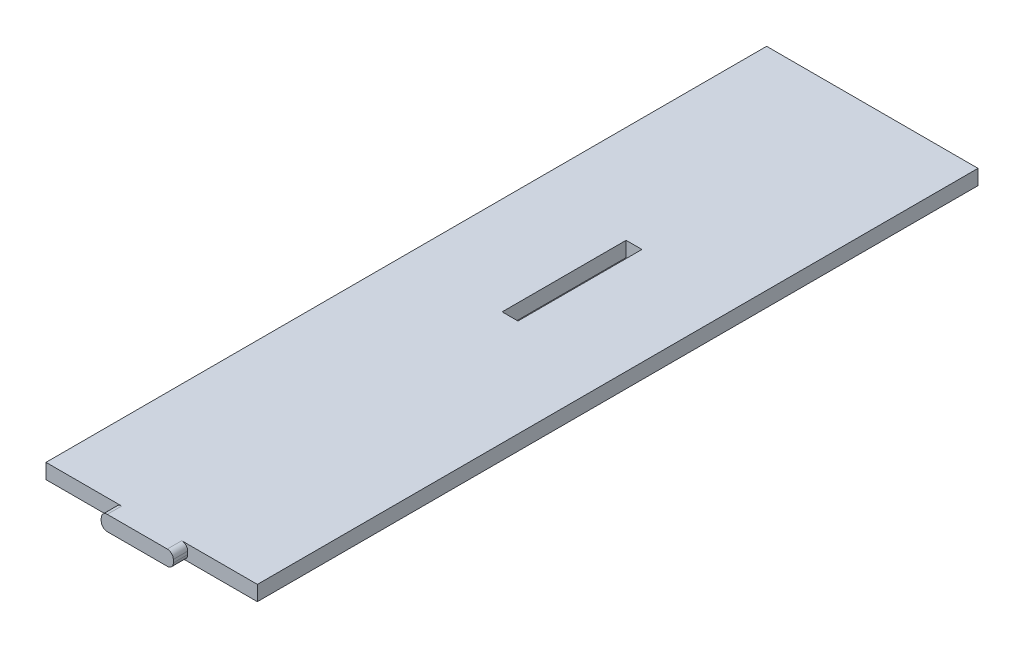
ISO-10303-21;
HEADER;
FILE_DESCRIPTION(('STEP AP214'),'2;1');
FILE_NAME('part.step','',(''),(''),'','','');
FILE_SCHEMA(('AUTOMOTIVE_DESIGN { 1 0 10303 214 1 1 1 1 }'));
ENDSEC;
DATA;
#1=APPLICATION_CONTEXT('core data for automotive mechanical design processes');
#2=APPLICATION_PROTOCOL_DEFINITION('international standard','automotive_design',2000,#1);
#3=PRODUCT_CONTEXT('',#1,'mechanical');
#4=PRODUCT('Part','Part','',(#3));
#5=PRODUCT_RELATED_PRODUCT_CATEGORY('part','',(#4));
#6=PRODUCT_DEFINITION_FORMATION('','',#4);
#7=PRODUCT_DEFINITION_CONTEXT('part definition',#1,'design');
#8=PRODUCT_DEFINITION('design','',#6,#7);
#9=PRODUCT_DEFINITION_SHAPE('','',#8);
#10=(LENGTH_UNIT() NAMED_UNIT(*) SI_UNIT(.MILLI.,.METRE.));
#11=(NAMED_UNIT(*) PLANE_ANGLE_UNIT() SI_UNIT($,.RADIAN.));
#12=(NAMED_UNIT(*) SI_UNIT($,.STERADIAN.) SOLID_ANGLE_UNIT());
#13=UNCERTAINTY_MEASURE_WITH_UNIT(LENGTH_MEASURE(1.E-05),#10,'distance_accuracy_value','');
#14=(GEOMETRIC_REPRESENTATION_CONTEXT(3) GLOBAL_UNCERTAINTY_ASSIGNED_CONTEXT((#13)) GLOBAL_UNIT_ASSIGNED_CONTEXT((#10,
#11,#12)) REPRESENTATION_CONTEXT('',''));
#15=CARTESIAN_POINT('',(0.,0.,0.));
#16=DIRECTION('',(0.,0.,1.));
#17=DIRECTION('',(1.,0.,0.));
#18=AXIS2_PLACEMENT_3D('',#15,#16,#17);
#19=CARTESIAN_POINT('',(-100.078955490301,12.5,350.));
#20=DIRECTION('',(0.,0.,-1.));
#21=DIRECTION('',(-1.,0.,0.));
#22=AXIS2_PLACEMENT_3D('',#19,#20,#21);
#23=PLANE('',#22);
#24=CARTESIAN_POINT('',(-37.0789554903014,4.99999999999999,350.));
#25=DIRECTION('',(0.,0.,1.));
#26=DIRECTION('',(1.,0.,0.));
#27=AXIS2_PLACEMENT_3D('',#24,#25,#26);
#28=CIRCLE('',#27,5.);
#29=CARTESIAN_POINT('',(-42.0789554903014,4.99999999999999,350.));
#30=VERTEX_POINT('',#29);
#31=CARTESIAN_POINT('',(-37.0789554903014,0.,350.));
#32=VERTEX_POINT('',#31);
#33=EDGE_CURVE('E48',#30,#32,#28,.T.);
#34=ORIENTED_EDGE('',*,*,#33,.F.);
#35=DIRECTION('',(0.,-1.,0.));
#36=VECTOR('',#35,1.);
#37=CARTESIAN_POINT('',(-42.0789554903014,7.5,350.));
#38=LINE('',#37,#36);
#39=CARTESIAN_POINT('',(-42.0789554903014,7.5,350.));
#40=VERTEX_POINT('',#39);
#41=EDGE_CURVE('E52',#40,#30,#38,.T.);
#42=ORIENTED_EDGE('',*,*,#41,.F.);
#43=CARTESIAN_POINT('',(-37.0789554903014,7.5,350.));
#44=DIRECTION('',(0.,0.,1.));
#45=DIRECTION('',(1.,0.,0.));
#46=AXIS2_PLACEMENT_3D('',#43,#44,#45);
#47=CIRCLE('',#46,5.);
#48=CARTESIAN_POINT('',(-37.0789554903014,12.5,350.));
#49=VERTEX_POINT('',#48);
#50=EDGE_CURVE('E264',#49,#40,#47,.T.);
#51=ORIENTED_EDGE('',*,*,#50,.F.);
#52=DIRECTION('',(1.,0.,0.));
#53=VECTOR('',#52,1.);
#54=CARTESIAN_POINT('',(-100.078955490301,12.5,350.));
#55=LINE('',#54,#53);
#56=CARTESIAN_POINT('',(-100.078955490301,12.5,350.));
#57=VERTEX_POINT('',#56);
#58=EDGE_CURVE('E210',#57,#49,#55,.T.);
#59=ORIENTED_EDGE('',*,*,#58,.F.);
#60=DIRECTION('',(0.,-1.,0.));
#61=VECTOR('',#60,1.);
#62=CARTESIAN_POINT('',(-100.078955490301,12.5,350.));
#63=LINE('',#62,#61);
#64=CARTESIAN_POINT('',(-100.078955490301,0.,350.));
#65=VERTEX_POINT('',#64);
#66=EDGE_CURVE('E11',#57,#65,#63,.T.);
#67=ORIENTED_EDGE('',*,*,#66,.T.);
#68=DIRECTION('',(1.,0.,0.));
#69=VECTOR('',#68,1.);
#70=CARTESIAN_POINT('',(-100.078955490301,0.,350.));
#71=LINE('',#70,#69);
#72=EDGE_CURVE('E221',#65,#32,#71,.T.);
#73=ORIENTED_EDGE('',*,*,#72,.T.);
#74=EDGE_LOOP('',(#34,#42,#51,#59,#67,#73));
#75=FACE_BOUND('',#74,.T.);
#76=ADVANCED_FACE('F33',(#75),#23,.F.);
#77=CARTESIAN_POINT('',(12.9210445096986,5.,350.));
#78=DIRECTION('',(0.,0.,1.));
#79=DIRECTION('',(1.,0.,0.));
#80=AXIS2_PLACEMENT_3D('',#77,#78,#79);
#81=CIRCLE('',#80,5.);
#82=CARTESIAN_POINT('',(12.9210445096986,0.,350.));
#83=VERTEX_POINT('',#82);
#84=CARTESIAN_POINT('',(17.9210445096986,5.,350.));
#85=VERTEX_POINT('',#84);
#86=EDGE_CURVE('E167',#83,#85,#81,.T.);
#87=ORIENTED_EDGE('',*,*,#86,.F.);
#88=CARTESIAN_POINT('',(75.9210445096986,0.,350.));
#89=VERTEX_POINT('',#88);
#90=EDGE_CURVE('E220',#83,#89,#71,.T.);
#91=ORIENTED_EDGE('',*,*,#90,.T.);
#92=DIRECTION('',(0.,-1.,0.));
#93=VECTOR('',#92,1.);
#94=CARTESIAN_POINT('',(75.9210445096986,12.5,350.));
#95=LINE('',#94,#93);
#96=CARTESIAN_POINT('',(75.9210445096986,12.5,350.));
#97=VERTEX_POINT('',#96);
#98=EDGE_CURVE('E41',#97,#89,#95,.T.);
#99=ORIENTED_EDGE('',*,*,#98,.F.);
#100=CARTESIAN_POINT('',(12.9210445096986,12.5,350.));
#101=VERTEX_POINT('',#100);
#102=EDGE_CURVE('E208',#101,#97,#55,.T.);
#103=ORIENTED_EDGE('',*,*,#102,.F.);
#104=CARTESIAN_POINT('',(12.9210445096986,7.50000000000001,350.));
#105=DIRECTION('',(0.,0.,1.));
#106=DIRECTION('',(-1.,0.,0.));
#107=AXIS2_PLACEMENT_3D('',#104,#105,#106);
#108=CIRCLE('',#107,5.);
#109=CARTESIAN_POINT('',(17.9210445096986,7.50000000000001,350.));
#110=VERTEX_POINT('',#109);
#111=EDGE_CURVE('E261',#110,#101,#108,.T.);
#112=ORIENTED_EDGE('',*,*,#111,.F.);
#113=DIRECTION('',(0.,1.,0.));
#114=VECTOR('',#113,1.);
#115=CARTESIAN_POINT('',(17.9210445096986,7.50000000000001,350.));
#116=LINE('',#115,#114);
#117=EDGE_CURVE('E265',#85,#110,#116,.T.);
#118=ORIENTED_EDGE('',*,*,#117,.F.);
#119=EDGE_LOOP('',(#87,#91,#99,#103,#112,#118));
#120=FACE_BOUND('',#119,.T.);
#121=ADVANCED_FACE('F260',(#120),#23,.F.);
#122=CARTESIAN_POINT('',(0.,12.5,0.));
#123=DIRECTION('',(0.,-1.,0.));
#124=DIRECTION('',(0.,0.,-1.));
#125=AXIS2_PLACEMENT_3D('',#122,#123,#124);
#126=PLANE('',#125);
#127=DIRECTION('',(0.,0.,1.));
#128=VECTOR('',#127,1.);
#129=CARTESIAN_POINT('',(-100.078955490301,12.5,350.));
#130=LINE('',#129,#128);
#131=CARTESIAN_POINT('',(-100.078955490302,12.5,-250.));
#132=VERTEX_POINT('',#131);
#133=EDGE_CURVE('E205',#132,#57,#130,.T.);
#134=ORIENTED_EDGE('',*,*,#133,.T.);
#135=ORIENTED_EDGE('',*,*,#58,.T.);
#136=DIRECTION('',(0.,0.,-1.));
#137=VECTOR('',#136,1.);
#138=CARTESIAN_POINT('',(-37.0789554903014,12.5,362.));
#139=LINE('',#138,#137);
#140=CARTESIAN_POINT('',(-37.0789554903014,12.5,362.));
#141=VERTEX_POINT('',#140);
#142=EDGE_CURVE('E284',#141,#49,#139,.T.);
#143=ORIENTED_EDGE('',*,*,#142,.F.);
#144=DIRECTION('',(-1.,0.,0.));
#145=VECTOR('',#144,1.);
#146=CARTESIAN_POINT('',(-37.0789554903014,12.5,362.));
#147=LINE('',#146,#145);
#148=CARTESIAN_POINT('',(12.9210445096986,12.5,362.));
#149=VERTEX_POINT('',#148);
#150=EDGE_CURVE('E290',#149,#141,#147,.T.);
#151=ORIENTED_EDGE('',*,*,#150,.F.);
#152=DIRECTION('',(0.,0.,-1.));
#153=VECTOR('',#152,1.);
#154=CARTESIAN_POINT('',(12.9210445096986,12.5,362.));
#155=LINE('',#154,#153);
#156=EDGE_CURVE('E173',#149,#101,#155,.T.);
#157=ORIENTED_EDGE('',*,*,#156,.T.);
#158=ORIENTED_EDGE('',*,*,#102,.T.);
#159=DIRECTION('',(0.,0.,-1.));
#160=VECTOR('',#159,1.);
#161=CARTESIAN_POINT('',(75.9210445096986,12.5,350.));
#162=LINE('',#161,#160);
#163=CARTESIAN_POINT('',(75.9210445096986,12.5,-250.));
#164=VERTEX_POINT('',#163);
#165=EDGE_CURVE('E213',#97,#164,#162,.T.);
#166=ORIENTED_EDGE('',*,*,#165,.T.);
#167=DIRECTION('',(-1.,0.,0.));
#168=VECTOR('',#167,1.);
#169=CARTESIAN_POINT('',(-100.078955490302,12.5,-250.));
#170=LINE('',#169,#168);
#171=EDGE_CURVE('E215',#164,#132,#170,.T.);
#172=ORIENTED_EDGE('',*,*,#171,.T.);
#173=EDGE_LOOP('',(#134,#135,#143,#151,#157,#158,#166,#172));
#174=FACE_BOUND('',#173,.T.);
#175=DIRECTION('',(-1.,0.,0.));
#176=VECTOR('',#175,1.);
#177=CARTESIAN_POINT('',(-18.6789554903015,12.5,-51.6));
#178=LINE('',#177,#176);
#179=CARTESIAN_POINT('',(-5.47895549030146,12.5,-51.6));
#180=VERTEX_POINT('',#179);
#181=CARTESIAN_POINT('',(-18.6789554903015,12.5,-51.6));
#182=VERTEX_POINT('',#181);
#183=EDGE_CURVE('E177',#180,#182,#178,.T.);
#184=ORIENTED_EDGE('',*,*,#183,.F.);
#185=DIRECTION('',(0.,0.,-1.));
#186=VECTOR('',#185,1.);
#187=CARTESIAN_POINT('',(-5.47895549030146,12.5,-51.6));
#188=LINE('',#187,#186);
#189=CARTESIAN_POINT('',(-5.47895549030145,12.5,51.6));
#190=VERTEX_POINT('',#189);
#191=EDGE_CURVE('E185',#190,#180,#188,.T.);
#192=ORIENTED_EDGE('',*,*,#191,.F.);
#193=DIRECTION('',(1.,0.,0.));
#194=VECTOR('',#193,1.);
#195=CARTESIAN_POINT('',(-18.6789554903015,12.5,51.6));
#196=LINE('',#195,#194);
#197=CARTESIAN_POINT('',(-18.6789554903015,12.5,51.6));
#198=VERTEX_POINT('',#197);
#199=EDGE_CURVE('E182',#198,#190,#196,.T.);
#200=ORIENTED_EDGE('',*,*,#199,.F.);
#201=DIRECTION('',(0.,0.,1.));
#202=VECTOR('',#201,1.);
#203=CARTESIAN_POINT('',(-18.6789554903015,12.5,-51.6));
#204=LINE('',#203,#202);
#205=EDGE_CURVE('E179',#182,#198,#204,.T.);
#206=ORIENTED_EDGE('',*,*,#205,.F.);
#207=EDGE_LOOP('',(#184,#192,#200,#206));
#208=FACE_BOUND('',#207,.T.);
#209=ADVANCED_FACE('F252',(#174,#208),#126,.F.);
#210=CARTESIAN_POINT('',(0.,0.,0.));
#211=DIRECTION('',(0.,-1.,0.));
#212=DIRECTION('',(0.,0.,-1.));
#213=AXIS2_PLACEMENT_3D('',#210,#211,#212);
#214=PLANE('',#213);
#215=DIRECTION('',(0.,0.,1.));
#216=VECTOR('',#215,1.);
#217=CARTESIAN_POINT('',(-100.078955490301,0.,350.));
#218=LINE('',#217,#216);
#219=CARTESIAN_POINT('',(-100.078955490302,0.,-250.));
#220=VERTEX_POINT('',#219);
#221=EDGE_CURVE('E204',#220,#65,#218,.T.);
#222=ORIENTED_EDGE('',*,*,#221,.F.);
#223=DIRECTION('',(-1.,0.,0.));
#224=VECTOR('',#223,1.);
#225=CARTESIAN_POINT('',(-100.078955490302,0.,-250.));
#226=LINE('',#225,#224);
#227=CARTESIAN_POINT('',(75.9210445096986,0.,-250.));
#228=VERTEX_POINT('',#227);
#229=EDGE_CURVE('E209',#228,#220,#226,.T.);
#230=ORIENTED_EDGE('',*,*,#229,.F.);
#231=DIRECTION('',(0.,0.,-1.));
#232=VECTOR('',#231,1.);
#233=CARTESIAN_POINT('',(75.9210445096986,0.,350.));
#234=LINE('',#233,#232);
#235=EDGE_CURVE('E223',#89,#228,#234,.T.);
#236=ORIENTED_EDGE('',*,*,#235,.F.);
#237=ORIENTED_EDGE('',*,*,#90,.F.);
#238=DIRECTION('',(0.,0.,-1.));
#239=VECTOR('',#238,1.);
#240=CARTESIAN_POINT('',(12.9210445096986,0.,362.));
#241=LINE('',#240,#239);
#242=CARTESIAN_POINT('',(12.9210445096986,0.,362.));
#243=VERTEX_POINT('',#242);
#244=EDGE_CURVE('E273',#243,#83,#241,.T.);
#245=ORIENTED_EDGE('',*,*,#244,.F.);
#246=DIRECTION('',(1.,0.,0.));
#247=VECTOR('',#246,1.);
#248=CARTESIAN_POINT('',(-37.0789554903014,0.,362.));
#249=LINE('',#248,#247);
#250=CARTESIAN_POINT('',(-37.0789554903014,0.,362.));
#251=VERTEX_POINT('',#250);
#252=EDGE_CURVE('E161',#251,#243,#249,.T.);
#253=ORIENTED_EDGE('',*,*,#252,.F.);
#254=DIRECTION('',(0.,0.,-1.));
#255=VECTOR('',#254,1.);
#256=CARTESIAN_POINT('',(-37.0789554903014,0.,362.));
#257=LINE('',#256,#255);
#258=EDGE_CURVE('E275',#251,#32,#257,.T.);
#259=ORIENTED_EDGE('',*,*,#258,.T.);
#260=ORIENTED_EDGE('',*,*,#72,.F.);
#261=EDGE_LOOP('',(#222,#230,#236,#237,#245,#253,#259,#260));
#262=FACE_BOUND('',#261,.T.);
#263=DIRECTION('',(0.,0.,-1.));
#264=VECTOR('',#263,1.);
#265=CARTESIAN_POINT('',(-5.47895549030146,0.,-51.6));
#266=LINE('',#265,#264);
#267=CARTESIAN_POINT('',(-5.47895549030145,0.,51.6));
#268=VERTEX_POINT('',#267);
#269=CARTESIAN_POINT('',(-5.47895549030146,0.,-51.6));
#270=VERTEX_POINT('',#269);
#271=EDGE_CURVE('E180',#268,#270,#266,.T.);
#272=ORIENTED_EDGE('',*,*,#271,.T.);
#273=DIRECTION('',(-1.,0.,0.));
#274=VECTOR('',#273,1.);
#275=CARTESIAN_POINT('',(-18.6789554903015,0.,-51.6));
#276=LINE('',#275,#274);
#277=CARTESIAN_POINT('',(-18.6789554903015,0.,-51.6));
#278=VERTEX_POINT('',#277);
#279=EDGE_CURVE('E168',#270,#278,#276,.T.);
#280=ORIENTED_EDGE('',*,*,#279,.T.);
#281=DIRECTION('',(0.,0.,1.));
#282=VECTOR('',#281,1.);
#283=CARTESIAN_POINT('',(-18.6789554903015,0.,-51.6));
#284=LINE('',#283,#282);
#285=CARTESIAN_POINT('',(-18.6789554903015,0.,51.6));
#286=VERTEX_POINT('',#285);
#287=EDGE_CURVE('E171',#278,#286,#284,.T.);
#288=ORIENTED_EDGE('',*,*,#287,.T.);
#289=DIRECTION('',(1.,0.,0.));
#290=VECTOR('',#289,1.);
#291=CARTESIAN_POINT('',(-18.6789554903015,0.,51.6));
#292=LINE('',#291,#290);
#293=EDGE_CURVE('E190',#286,#268,#292,.T.);
#294=ORIENTED_EDGE('',*,*,#293,.T.);
#295=EDGE_LOOP('',(#272,#280,#288,#294));
#296=FACE_BOUND('',#295,.T.);
#297=ADVANCED_FACE('F242',(#262,#296),#214,.T.);
#298=CARTESIAN_POINT('',(-100.078955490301,12.5,350.));
#299=DIRECTION('',(1.,0.,0.));
#300=DIRECTION('',(0.,0.,-1.));
#301=AXIS2_PLACEMENT_3D('',#298,#299,#300);
#302=PLANE('',#301);
#303=ORIENTED_EDGE('',*,*,#221,.T.);
#304=ORIENTED_EDGE('',*,*,#66,.F.);
#305=ORIENTED_EDGE('',*,*,#133,.F.);
#306=DIRECTION('',(0.,-1.,0.));
#307=VECTOR('',#306,1.);
#308=CARTESIAN_POINT('',(-100.078955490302,12.5,-250.));
#309=LINE('',#308,#307);
#310=EDGE_CURVE('E217',#132,#220,#309,.T.);
#311=ORIENTED_EDGE('',*,*,#310,.T.);
#312=EDGE_LOOP('',(#303,#304,#305,#311));
#313=FACE_BOUND('',#312,.T.);
#314=ADVANCED_FACE('F35',(#313),#302,.F.);
#315=CARTESIAN_POINT('',(75.9210445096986,12.5,350.));
#316=DIRECTION('',(-1.,0.,0.));
#317=DIRECTION('',(0.,0.,1.));
#318=AXIS2_PLACEMENT_3D('',#315,#316,#317);
#319=PLANE('',#318);
#320=ORIENTED_EDGE('',*,*,#235,.T.);
#321=DIRECTION('',(0.,-1.,0.));
#322=VECTOR('',#321,1.);
#323=CARTESIAN_POINT('',(75.9210445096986,12.5,-250.));
#324=LINE('',#323,#322);
#325=EDGE_CURVE('E228',#164,#228,#324,.T.);
#326=ORIENTED_EDGE('',*,*,#325,.F.);
#327=ORIENTED_EDGE('',*,*,#165,.F.);
#328=ORIENTED_EDGE('',*,*,#98,.T.);
#329=EDGE_LOOP('',(#320,#326,#327,#328));
#330=FACE_BOUND('',#329,.T.);
#331=ADVANCED_FACE('F235',(#330),#319,.F.);
#332=CARTESIAN_POINT('',(-100.078955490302,12.5,-250.));
#333=DIRECTION('',(0.,0.,1.));
#334=DIRECTION('',(1.,0.,0.));
#335=AXIS2_PLACEMENT_3D('',#332,#333,#334);
#336=PLANE('',#335);
#337=ORIENTED_EDGE('',*,*,#229,.T.);
#338=ORIENTED_EDGE('',*,*,#310,.F.);
#339=ORIENTED_EDGE('',*,*,#171,.F.);
#340=ORIENTED_EDGE('',*,*,#325,.T.);
#341=EDGE_LOOP('',(#337,#338,#339,#340));
#342=FACE_BOUND('',#341,.T.);
#343=ADVANCED_FACE('F246',(#342),#336,.F.);
#344=CARTESIAN_POINT('',(-18.6789554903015,12.5,-51.6));
#345=DIRECTION('',(0.,0.,1.));
#346=DIRECTION('',(1.,0.,0.));
#347=AXIS2_PLACEMENT_3D('',#344,#345,#346);
#348=PLANE('',#347);
#349=ORIENTED_EDGE('',*,*,#279,.F.);
#350=DIRECTION('',(0.,-1.,0.));
#351=VECTOR('',#350,1.);
#352=CARTESIAN_POINT('',(-5.47895549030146,12.5,-51.6));
#353=LINE('',#352,#351);
#354=EDGE_CURVE('E186',#180,#270,#353,.T.);
#355=ORIENTED_EDGE('',*,*,#354,.F.);
#356=ORIENTED_EDGE('',*,*,#183,.T.);
#357=DIRECTION('',(0.,-1.,0.));
#358=VECTOR('',#357,1.);
#359=CARTESIAN_POINT('',(-18.6789554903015,12.5,-51.6));
#360=LINE('',#359,#358);
#361=EDGE_CURVE('E201',#182,#278,#360,.T.);
#362=ORIENTED_EDGE('',*,*,#361,.T.);
#363=EDGE_LOOP('',(#349,#355,#356,#362));
#364=FACE_BOUND('',#363,.T.);
#365=ADVANCED_FACE('F314',(#364),#348,.T.);
#366=CARTESIAN_POINT('',(-18.6789554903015,12.5,-51.6));
#367=DIRECTION('',(1.,0.,0.));
#368=DIRECTION('',(0.,0.,-1.));
#369=AXIS2_PLACEMENT_3D('',#366,#367,#368);
#370=PLANE('',#369);
#371=ORIENTED_EDGE('',*,*,#287,.F.);
#372=ORIENTED_EDGE('',*,*,#361,.F.);
#373=ORIENTED_EDGE('',*,*,#205,.T.);
#374=DIRECTION('',(0.,-1.,0.));
#375=VECTOR('',#374,1.);
#376=CARTESIAN_POINT('',(-18.6789554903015,12.5,51.6));
#377=LINE('',#376,#375);
#378=EDGE_CURVE('E199',#198,#286,#377,.T.);
#379=ORIENTED_EDGE('',*,*,#378,.T.);
#380=EDGE_LOOP('',(#371,#372,#373,#379));
#381=FACE_BOUND('',#380,.T.);
#382=ADVANCED_FACE('F321',(#381),#370,.T.);
#383=CARTESIAN_POINT('',(-18.6789554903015,12.5,51.6));
#384=DIRECTION('',(0.,0.,-1.));
#385=DIRECTION('',(-1.,0.,0.));
#386=AXIS2_PLACEMENT_3D('',#383,#384,#385);
#387=PLANE('',#386);
#388=ORIENTED_EDGE('',*,*,#293,.F.);
#389=ORIENTED_EDGE('',*,*,#378,.F.);
#390=ORIENTED_EDGE('',*,*,#199,.T.);
#391=DIRECTION('',(0.,-1.,0.));
#392=VECTOR('',#391,1.);
#393=CARTESIAN_POINT('',(-5.47895549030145,12.5,51.6));
#394=LINE('',#393,#392);
#395=EDGE_CURVE('E197',#190,#268,#394,.T.);
#396=ORIENTED_EDGE('',*,*,#395,.T.);
#397=EDGE_LOOP('',(#388,#389,#390,#396));
#398=FACE_BOUND('',#397,.T.);
#399=ADVANCED_FACE('F325',(#398),#387,.T.);
#400=CARTESIAN_POINT('',(-5.47895549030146,12.5,-51.6));
#401=DIRECTION('',(-1.,0.,0.));
#402=DIRECTION('',(0.,0.,1.));
#403=AXIS2_PLACEMENT_3D('',#400,#401,#402);
#404=PLANE('',#403);
#405=ORIENTED_EDGE('',*,*,#271,.F.);
#406=ORIENTED_EDGE('',*,*,#395,.F.);
#407=ORIENTED_EDGE('',*,*,#191,.T.);
#408=ORIENTED_EDGE('',*,*,#354,.T.);
#409=EDGE_LOOP('',(#405,#406,#407,#408));
#410=FACE_BOUND('',#409,.T.);
#411=ADVANCED_FACE('F329',(#410),#404,.T.);
#412=CARTESIAN_POINT('',(12.9210445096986,5.,362.));
#413=DIRECTION('',(0.,0.,-1.));
#414=DIRECTION('',(-1.,0.,0.));
#415=AXIS2_PLACEMENT_3D('',#412,#413,#414);
#416=CYLINDRICAL_SURFACE('',#415,5.);
#417=ORIENTED_EDGE('',*,*,#86,.T.);
#418=DIRECTION('',(0.,0.,-1.));
#419=VECTOR('',#418,1.);
#420=CARTESIAN_POINT('',(17.9210445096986,5.,362.));
#421=LINE('',#420,#419);
#422=CARTESIAN_POINT('',(17.9210445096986,5.,362.));
#423=VERTEX_POINT('',#422);
#424=EDGE_CURVE('E149',#423,#85,#421,.T.);
#425=ORIENTED_EDGE('',*,*,#424,.F.);
#426=CARTESIAN_POINT('',(12.9210445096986,5.,362.));
#427=DIRECTION('',(0.,0.,1.));
#428=DIRECTION('',(1.,0.,0.));
#429=AXIS2_PLACEMENT_3D('',#426,#427,#428);
#430=CIRCLE('',#429,5.);
#431=EDGE_CURVE('E156',#243,#423,#430,.T.);
#432=ORIENTED_EDGE('',*,*,#431,.F.);
#433=ORIENTED_EDGE('',*,*,#244,.T.);
#434=EDGE_LOOP('',(#417,#425,#432,#433));
#435=FACE_BOUND('',#434,.T.);
#436=ADVANCED_FACE('F166',(#435),#416,.T.);
#437=CARTESIAN_POINT('',(17.9210445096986,7.50000000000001,362.));
#438=DIRECTION('',(-1.,0.,0.));
#439=DIRECTION('',(0.,0.,1.));
#440=AXIS2_PLACEMENT_3D('',#437,#438,#439);
#441=PLANE('',#440);
#442=ORIENTED_EDGE('',*,*,#117,.T.);
#443=DIRECTION('',(0.,0.,-1.));
#444=VECTOR('',#443,1.);
#445=CARTESIAN_POINT('',(17.9210445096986,7.50000000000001,362.));
#446=LINE('',#445,#444);
#447=CARTESIAN_POINT('',(17.9210445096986,7.50000000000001,362.));
#448=VERTEX_POINT('',#447);
#449=EDGE_CURVE('E152',#448,#110,#446,.T.);
#450=ORIENTED_EDGE('',*,*,#449,.F.);
#451=DIRECTION('',(0.,1.,0.));
#452=VECTOR('',#451,1.);
#453=CARTESIAN_POINT('',(17.9210445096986,7.50000000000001,362.));
#454=LINE('',#453,#452);
#455=EDGE_CURVE('E144',#423,#448,#454,.T.);
#456=ORIENTED_EDGE('',*,*,#455,.F.);
#457=ORIENTED_EDGE('',*,*,#424,.T.);
#458=EDGE_LOOP('',(#442,#450,#456,#457));
#459=FACE_BOUND('',#458,.T.);
#460=ADVANCED_FACE('F147',(#459),#441,.F.);
#461=CARTESIAN_POINT('',(12.9210445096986,7.50000000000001,362.));
#462=DIRECTION('',(0.,0.,-1.));
#463=DIRECTION('',(-1.,0.,0.));
#464=AXIS2_PLACEMENT_3D('',#461,#462,#463);
#465=CYLINDRICAL_SURFACE('',#464,5.);
#466=ORIENTED_EDGE('',*,*,#111,.T.);
#467=ORIENTED_EDGE('',*,*,#156,.F.);
#468=CARTESIAN_POINT('',(12.9210445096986,7.50000000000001,362.));
#469=DIRECTION('',(0.,0.,1.));
#470=DIRECTION('',(-1.,0.,0.));
#471=AXIS2_PLACEMENT_3D('',#468,#469,#470);
#472=CIRCLE('',#471,5.);
#473=EDGE_CURVE('E155',#448,#149,#472,.T.);
#474=ORIENTED_EDGE('',*,*,#473,.F.);
#475=ORIENTED_EDGE('',*,*,#449,.T.);
#476=EDGE_LOOP('',(#466,#467,#474,#475));
#477=FACE_BOUND('',#476,.T.);
#478=ADVANCED_FACE('F263',(#477),#465,.T.);
#479=CARTESIAN_POINT('',(-37.0789554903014,7.5,362.));
#480=DIRECTION('',(0.,0.,-1.));
#481=DIRECTION('',(-1.,0.,0.));
#482=AXIS2_PLACEMENT_3D('',#479,#480,#481);
#483=CYLINDRICAL_SURFACE('',#482,5.);
#484=ORIENTED_EDGE('',*,*,#50,.T.);
#485=DIRECTION('',(0.,0.,-1.));
#486=VECTOR('',#485,1.);
#487=CARTESIAN_POINT('',(-42.0789554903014,7.5,362.));
#488=LINE('',#487,#486);
#489=CARTESIAN_POINT('',(-42.0789554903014,7.5,362.));
#490=VERTEX_POINT('',#489);
#491=EDGE_CURVE('E281',#490,#40,#488,.T.);
#492=ORIENTED_EDGE('',*,*,#491,.F.);
#493=CARTESIAN_POINT('',(-37.0789554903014,7.5,362.));
#494=DIRECTION('',(0.,0.,1.));
#495=DIRECTION('',(1.,0.,0.));
#496=AXIS2_PLACEMENT_3D('',#493,#494,#495);
#497=CIRCLE('',#496,5.);
#498=EDGE_CURVE('E289',#141,#490,#497,.T.);
#499=ORIENTED_EDGE('',*,*,#498,.F.);
#500=ORIENTED_EDGE('',*,*,#142,.T.);
#501=EDGE_LOOP('',(#484,#492,#499,#500));
#502=FACE_BOUND('',#501,.T.);
#503=ADVANCED_FACE('F287',(#502),#483,.T.);
#504=CARTESIAN_POINT('',(-42.0789554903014,7.5,362.));
#505=DIRECTION('',(1.,0.,0.));
#506=DIRECTION('',(0.,0.,-1.));
#507=AXIS2_PLACEMENT_3D('',#504,#505,#506);
#508=PLANE('',#507);
#509=ORIENTED_EDGE('',*,*,#41,.T.);
#510=DIRECTION('',(0.,0.,-1.));
#511=VECTOR('',#510,1.);
#512=CARTESIAN_POINT('',(-42.0789554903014,4.99999999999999,362.));
#513=LINE('',#512,#511);
#514=CARTESIAN_POINT('',(-42.0789554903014,4.99999999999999,362.));
#515=VERTEX_POINT('',#514);
#516=EDGE_CURVE('E278',#515,#30,#513,.T.);
#517=ORIENTED_EDGE('',*,*,#516,.F.);
#518=DIRECTION('',(0.,-1.,0.));
#519=VECTOR('',#518,1.);
#520=CARTESIAN_POINT('',(-42.0789554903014,7.5,362.));
#521=LINE('',#520,#519);
#522=EDGE_CURVE('E292',#490,#515,#521,.T.);
#523=ORIENTED_EDGE('',*,*,#522,.F.);
#524=ORIENTED_EDGE('',*,*,#491,.T.);
#525=EDGE_LOOP('',(#509,#517,#523,#524));
#526=FACE_BOUND('',#525,.T.);
#527=ADVANCED_FACE('F342',(#526),#508,.F.);
#528=CARTESIAN_POINT('',(-37.0789554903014,4.99999999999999,362.));
#529=DIRECTION('',(0.,0.,-1.));
#530=DIRECTION('',(-1.,0.,0.));
#531=AXIS2_PLACEMENT_3D('',#528,#529,#530);
#532=CYLINDRICAL_SURFACE('',#531,5.);
#533=ORIENTED_EDGE('',*,*,#33,.T.);
#534=ORIENTED_EDGE('',*,*,#258,.F.);
#535=CARTESIAN_POINT('',(-37.0789554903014,4.99999999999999,362.));
#536=DIRECTION('',(0.,0.,1.));
#537=DIRECTION('',(1.,0.,0.));
#538=AXIS2_PLACEMENT_3D('',#535,#536,#537);
#539=CIRCLE('',#538,5.);
#540=EDGE_CURVE('E297',#515,#251,#539,.T.);
#541=ORIENTED_EDGE('',*,*,#540,.F.);
#542=ORIENTED_EDGE('',*,*,#516,.T.);
#543=EDGE_LOOP('',(#533,#534,#541,#542));
#544=FACE_BOUND('',#543,.T.);
#545=ADVANCED_FACE('F304',(#544),#532,.T.);
#546=CARTESIAN_POINT('',(12.9210445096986,5.,362.));
#547=DIRECTION('',(0.,0.,1.));
#548=DIRECTION('',(1.,0.,0.));
#549=AXIS2_PLACEMENT_3D('',#546,#547,#548);
#550=PLANE('',#549);
#551=ORIENTED_EDGE('',*,*,#431,.T.);
#552=ORIENTED_EDGE('',*,*,#455,.T.);
#553=ORIENTED_EDGE('',*,*,#473,.T.);
#554=ORIENTED_EDGE('',*,*,#150,.T.);
#555=ORIENTED_EDGE('',*,*,#498,.T.);
#556=ORIENTED_EDGE('',*,*,#522,.T.);
#557=ORIENTED_EDGE('',*,*,#540,.T.);
#558=ORIENTED_EDGE('',*,*,#252,.T.);
#559=EDGE_LOOP('',(#551,#552,#553,#554,#555,#556,#557,#558));
#560=FACE_BOUND('',#559,.T.);
#561=ADVANCED_FACE('F159',(#560),#550,.T.);
#562=CLOSED_SHELL('',(#76,#121,#209,#297,#314,#331,#343,#365,#382,#399,#411,#436,#460,#478,#503,
#527,#545,#561));
#563=MANIFOLD_SOLID_BREP('B2',#562);
#564=ADVANCED_BREP_SHAPE_REPRESENTATION('',(#18,#563),#14);
#565=SHAPE_DEFINITION_REPRESENTATION(#9,#564);
ENDSEC;
END-ISO-10303-21;
